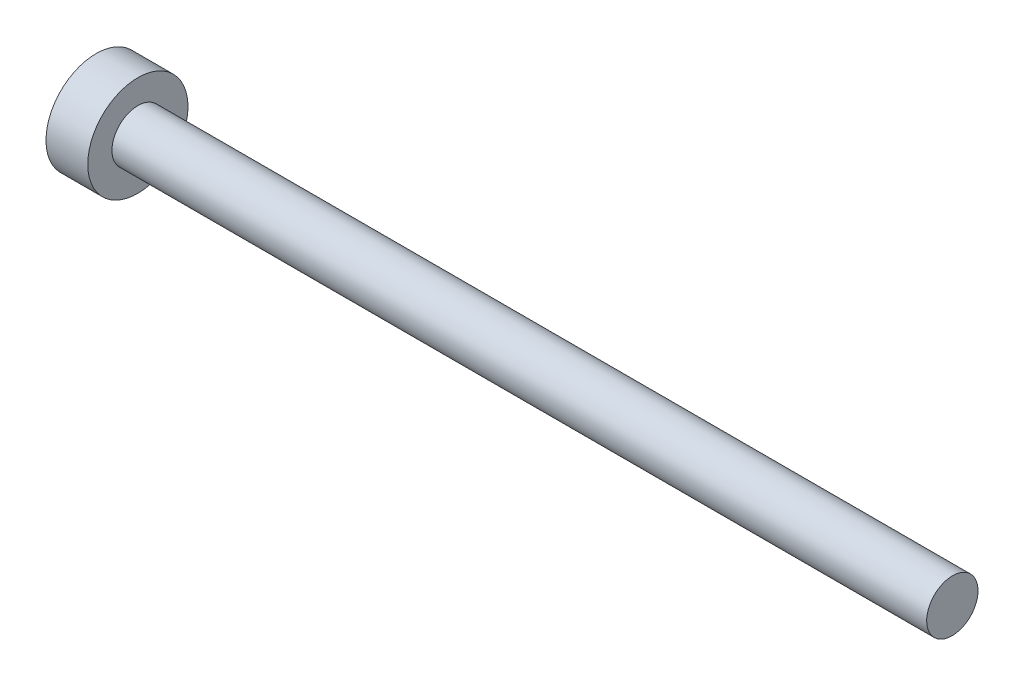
ISO-10303-21;
HEADER;
FILE_DESCRIPTION(('STEP AP214'),'2;1');
FILE_NAME('part.step','',(''),(''),'','','');
FILE_SCHEMA(('AUTOMOTIVE_DESIGN { 1 0 10303 214 1 1 1 1 }'));
ENDSEC;
DATA;
#1=APPLICATION_CONTEXT('core data for automotive mechanical design processes');
#2=APPLICATION_PROTOCOL_DEFINITION('international standard','automotive_design',2000,#1);
#3=PRODUCT_CONTEXT('',#1,'mechanical');
#4=PRODUCT('Part','Part','',(#3));
#5=PRODUCT_RELATED_PRODUCT_CATEGORY('part','',(#4));
#6=PRODUCT_DEFINITION_FORMATION('','',#4);
#7=PRODUCT_DEFINITION_CONTEXT('part definition',#1,'design');
#8=PRODUCT_DEFINITION('design','',#6,#7);
#9=PRODUCT_DEFINITION_SHAPE('','',#8);
#10=(LENGTH_UNIT() NAMED_UNIT(*) SI_UNIT(.MILLI.,.METRE.));
#11=(NAMED_UNIT(*) PLANE_ANGLE_UNIT() SI_UNIT($,.RADIAN.));
#12=(NAMED_UNIT(*) SI_UNIT($,.STERADIAN.) SOLID_ANGLE_UNIT());
#13=UNCERTAINTY_MEASURE_WITH_UNIT(LENGTH_MEASURE(1.E-05),#10,'distance_accuracy_value','');
#14=(GEOMETRIC_REPRESENTATION_CONTEXT(3) GLOBAL_UNCERTAINTY_ASSIGNED_CONTEXT((#13)) GLOBAL_UNIT_ASSIGNED_CONTEXT((#10,
#11,#12)) REPRESENTATION_CONTEXT('',''));
#15=CARTESIAN_POINT('',(0.,0.,0.));
#16=DIRECTION('',(0.,0.,1.));
#17=DIRECTION('',(1.,0.,0.));
#18=AXIS2_PLACEMENT_3D('',#15,#16,#17);
#19=CARTESIAN_POINT('',(-986.4,-42.687,-15.81));
#20=DIRECTION('',(1.,0.,0.));
#21=DIRECTION('',(0.,0.,-1.));
#22=AXIS2_PLACEMENT_3D('',#19,#20,#21);
#23=CYLINDRICAL_SURFACE('',#22,3.1);
#24=CARTESIAN_POINT('',(-114.2,-42.687,-15.81));
#25=DIRECTION('',(-1.,0.,0.));
#26=DIRECTION('',(0.,0.,1.));
#27=AXIS2_PLACEMENT_3D('',#24,#25,#26);
#28=CIRCLE('',#27,3.1);
#29=CARTESIAN_POINT('',(-114.2,-42.687,-12.71));
#30=VERTEX_POINT('',#29);
#31=EDGE_CURVE('E10',#30,#30,#28,.F.);
#32=ORIENTED_EDGE('',*,*,#31,.T.);
#33=EDGE_LOOP('',(#32));
#34=FACE_BOUND('',#33,.T.);
#35=CARTESIAN_POINT('',(-16.6619717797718,-42.687,-15.81));
#36=DIRECTION('',(0.999961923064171,0.,-0.00872653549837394));
#37=DIRECTION('',(0.00872653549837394,0.,0.999961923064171));
#38=AXIS2_PLACEMENT_3D('',#35,#36,#37);
#39=ELLIPSE('',#38,3.10011804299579,3.1);
#40=CARTESIAN_POINT('',(-16.6349184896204,-42.687,-12.71));
#41=VERTEX_POINT('',#40);
#42=EDGE_CURVE('E17',#41,#41,#39,.F.);
#43=ORIENTED_EDGE('',*,*,#42,.T.);
#44=EDGE_LOOP('',(#43));
#45=FACE_BOUND('',#44,.T.);
#46=ADVANCED_FACE('F14',(#34,#45),#23,.T.);
#47=CARTESIAN_POINT('',(-114.2,-42.687,-15.81));
#48=DIRECTION('',(-1.,0.,0.));
#49=DIRECTION('',(0.,0.,1.));
#50=AXIS2_PLACEMENT_3D('',#47,#48,#49);
#51=CYLINDRICAL_SURFACE('',#50,6.);
#52=CARTESIAN_POINT('',(-114.2,-42.687,-15.81));
#53=DIRECTION('',(-1.,0.,0.));
#54=DIRECTION('',(0.,0.,1.));
#55=AXIS2_PLACEMENT_3D('',#52,#53,#54);
#56=CIRCLE('',#55,6.);
#57=CARTESIAN_POINT('',(-114.2,-42.687,-9.81));
#58=VERTEX_POINT('',#57);
#59=EDGE_CURVE('E21',#58,#58,#56,.T.);
#60=ORIENTED_EDGE('',*,*,#59,.T.);
#61=EDGE_LOOP('',(#60));
#62=FACE_BOUND('',#61,.T.);
#63=CARTESIAN_POINT('',(-119.2,-42.687,-15.81));
#64=DIRECTION('',(-1.,0.,0.));
#65=DIRECTION('',(0.,0.,1.));
#66=AXIS2_PLACEMENT_3D('',#63,#64,#65);
#67=CIRCLE('',#66,6.);
#68=CARTESIAN_POINT('',(-119.2,-42.687,-9.81));
#69=VERTEX_POINT('',#68);
#70=EDGE_CURVE('E25',#69,#69,#67,.T.);
#71=ORIENTED_EDGE('',*,*,#70,.F.);
#72=EDGE_LOOP('',(#71));
#73=FACE_BOUND('',#72,.T.);
#74=ADVANCED_FACE('F47',(#62,#73),#51,.T.);
#75=CARTESIAN_POINT('',(-114.2,-42.687,-15.81));
#76=DIRECTION('',(-1.,0.,0.));
#77=DIRECTION('',(0.,0.,1.));
#78=AXIS2_PLACEMENT_3D('',#75,#76,#77);
#79=PLANE('',#78);
#80=ORIENTED_EDGE('',*,*,#31,.F.);
#81=EDGE_LOOP('',(#80));
#82=FACE_BOUND('',#81,.T.);
#83=ORIENTED_EDGE('',*,*,#59,.F.);
#84=EDGE_LOOP('',(#83));
#85=FACE_BOUND('',#84,.T.);
#86=ADVANCED_FACE('F43',(#82,#85),#79,.F.);
#87=CARTESIAN_POINT('',(-119.2,-42.687,-15.81));
#88=DIRECTION('',(-1.,0.,0.));
#89=DIRECTION('',(0.,0.,1.));
#90=AXIS2_PLACEMENT_3D('',#87,#88,#89);
#91=PLANE('',#90);
#92=ORIENTED_EDGE('',*,*,#70,.T.);
#93=EDGE_LOOP('',(#92));
#94=FACE_BOUND('',#93,.T.);
#95=ADVANCED_FACE('F37',(#94),#91,.T.);
#96=CARTESIAN_POINT('',(-16.6152394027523,-42.687,-10.455));
#97=DIRECTION('',(0.999961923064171,0.,-0.00872653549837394));
#98=DIRECTION('',(-0.00872653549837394,0.,-0.999961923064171));
#99=AXIS2_PLACEMENT_3D('',#96,#97,#98);
#100=PLANE('',#99);
#101=ORIENTED_EDGE('',*,*,#42,.F.);
#102=EDGE_LOOP('',(#101));
#103=FACE_BOUND('',#102,.T.);
#104=ADVANCED_FACE('F35',(#103),#100,.T.);
#105=CLOSED_SHELL('',(#46,#74,#86,#95,#104));
#106=MANIFOLD_SOLID_BREP('B1',#105);
#107=ADVANCED_BREP_SHAPE_REPRESENTATION('',(#18,#106),#14);
#108=SHAPE_DEFINITION_REPRESENTATION(#9,#107);
ENDSEC;
END-ISO-10303-21;
